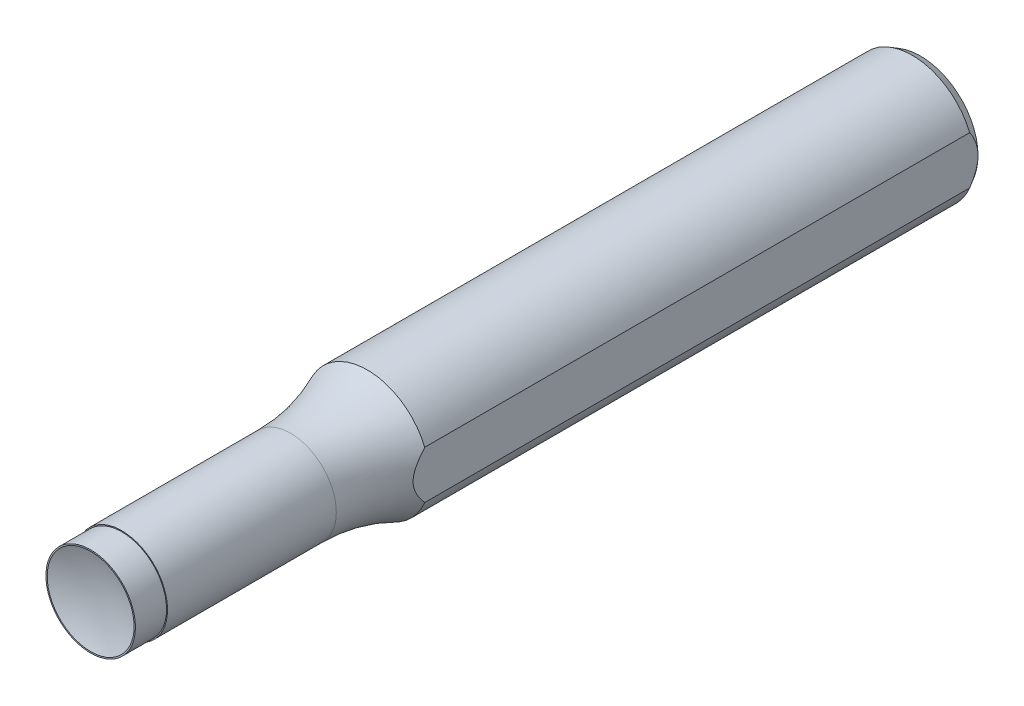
ISO-10303-21;
HEADER;
FILE_DESCRIPTION(('STEP AP214'),'2;1');
FILE_NAME('part.step','',(''),(''),'','','');
FILE_SCHEMA(('AUTOMOTIVE_DESIGN { 1 0 10303 214 1 1 1 1 }'));
ENDSEC;
DATA;
#1=APPLICATION_CONTEXT('core data for automotive mechanical design processes');
#2=APPLICATION_PROTOCOL_DEFINITION('international standard','automotive_design',2000,#1);
#3=PRODUCT_CONTEXT('',#1,'mechanical');
#4=PRODUCT('Part','Part','',(#3));
#5=PRODUCT_RELATED_PRODUCT_CATEGORY('part','',(#4));
#6=PRODUCT_DEFINITION_FORMATION('','',#4);
#7=PRODUCT_DEFINITION_CONTEXT('part definition',#1,'design');
#8=PRODUCT_DEFINITION('design','',#6,#7);
#9=PRODUCT_DEFINITION_SHAPE('','',#8);
#10=(LENGTH_UNIT() NAMED_UNIT(*) SI_UNIT(.MILLI.,.METRE.));
#11=(NAMED_UNIT(*) PLANE_ANGLE_UNIT() SI_UNIT($,.RADIAN.));
#12=(NAMED_UNIT(*) SI_UNIT($,.STERADIAN.) SOLID_ANGLE_UNIT());
#13=UNCERTAINTY_MEASURE_WITH_UNIT(LENGTH_MEASURE(1.E-05),#10,'distance_accuracy_value','');
#14=(GEOMETRIC_REPRESENTATION_CONTEXT(3) GLOBAL_UNCERTAINTY_ASSIGNED_CONTEXT((#13)) GLOBAL_UNIT_ASSIGNED_CONTEXT((#10,
#11,#12)) REPRESENTATION_CONTEXT('',''));
#15=CARTESIAN_POINT('',(0.,0.,0.));
#16=DIRECTION('',(0.,0.,1.));
#17=DIRECTION('',(1.,0.,0.));
#18=AXIS2_PLACEMENT_3D('',#15,#16,#17);
#19=CARTESIAN_POINT('',(0.,0.,-42.3333333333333));
#20=DIRECTION('',(0.,0.,1.));
#21=DIRECTION('',(1.,0.,0.));
#22=AXIS2_PLACEMENT_3D('',#19,#20,#21);
#23=CYLINDRICAL_SURFACE('',#22,7.);
#24=CARTESIAN_POINT('',(0.,0.,-30.5890528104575));
#25=DIRECTION('',(0.,0.,1.));
#26=DIRECTION('',(0.,-1.,0.));
#27=AXIS2_PLACEMENT_3D('',#24,#25,#26);
#28=CIRCLE('',#27,7.);
#29=CARTESIAN_POINT('',(0.,-7.,-30.5890528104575));
#30=VERTEX_POINT('',#29);
#31=EDGE_CURVE('E79',#30,#30,#28,.F.);
#32=ORIENTED_EDGE('',*,*,#31,.F.);
#33=EDGE_LOOP('',(#32));
#34=FACE_BOUND('',#33,.T.);
#35=CARTESIAN_POINT('',(0.,0.,-4.7625));
#36=DIRECTION('',(0.,0.,1.));
#37=DIRECTION('',(1.,0.,0.));
#38=AXIS2_PLACEMENT_3D('',#35,#36,#37);
#39=CIRCLE('',#38,7.);
#40=CARTESIAN_POINT('',(7.,0.,-4.7625));
#41=VERTEX_POINT('',#40);
#42=EDGE_CURVE('E90',#41,#41,#39,.F.);
#43=ORIENTED_EDGE('',*,*,#42,.T.);
#44=EDGE_LOOP('',(#43));
#45=FACE_BOUND('',#44,.T.);
#46=ADVANCED_FACE('F42',(#34,#45),#23,.T.);
#47=CARTESIAN_POINT('',(0.,0.,-4.7625));
#48=DIRECTION('',(0.,0.,1.));
#49=DIRECTION('',(1.,0.,0.));
#50=AXIS2_PLACEMENT_3D('',#47,#48,#49);
#51=PLANE('',#50);
#52=ORIENTED_EDGE('',*,*,#42,.F.);
#53=EDGE_LOOP('',(#52));
#54=FACE_BOUND('',#53,.T.);
#55=CARTESIAN_POINT('',(0.,0.,-4.7625));
#56=DIRECTION('',(0.,0.,1.));
#57=DIRECTION('',(1.,0.,0.));
#58=AXIS2_PLACEMENT_3D('',#55,#56,#57);
#59=CIRCLE('',#58,6.85);
#60=CARTESIAN_POINT('',(6.85,0.,-4.7625));
#61=VERTEX_POINT('',#60);
#62=EDGE_CURVE('E97',#61,#61,#59,.T.);
#63=ORIENTED_EDGE('',*,*,#62,.F.);
#64=EDGE_LOOP('',(#63));
#65=FACE_BOUND('',#64,.T.);
#66=ADVANCED_FACE('F108',(#54,#65),#51,.T.);
#67=CARTESIAN_POINT('',(0.,0.,-4.7625));
#68=DIRECTION('',(0.,0.,1.));
#69=DIRECTION('',(1.,0.,0.));
#70=AXIS2_PLACEMENT_3D('',#67,#68,#69);
#71=CYLINDRICAL_SURFACE('',#70,6.85);
#72=CARTESIAN_POINT('',(0.,0.,0.));
#73=DIRECTION('',(0.,0.,1.));
#74=DIRECTION('',(1.,0.,0.));
#75=AXIS2_PLACEMENT_3D('',#72,#73,#74);
#76=CIRCLE('',#75,6.85);
#77=CARTESIAN_POINT('',(6.85,0.,0.));
#78=VERTEX_POINT('',#77);
#79=EDGE_CURVE('E120',#78,#78,#76,.T.);
#80=CARTESIAN_POINT('',(6.85,0.,-4.7625));
#81=CARTESIAN_POINT('',(6.85,0.,-4.712890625));
#82=CARTESIAN_POINT('',(6.85,0.,-4.66328125));
#83=CARTESIAN_POINT('',(6.85,0.,-4.5640625));
#84=CARTESIAN_POINT('',(6.85,0.,-4.514453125));
#85=CARTESIAN_POINT('',(6.85,0.,-4.415234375));
#86=CARTESIAN_POINT('',(6.85,0.,-4.365625));
#87=CARTESIAN_POINT('',(6.85,0.,-4.26640625));
#88=CARTESIAN_POINT('',(6.85,0.,-4.216796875));
#89=CARTESIAN_POINT('',(6.85,0.,-4.117578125));
#90=CARTESIAN_POINT('',(6.85,0.,-4.06796875));
#91=CARTESIAN_POINT('',(6.85,0.,-3.96875));
#92=CARTESIAN_POINT('',(6.85,0.,-3.919140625));
#93=CARTESIAN_POINT('',(6.85,0.,-3.819921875));
#94=CARTESIAN_POINT('',(6.85,0.,-3.7703125));
#95=CARTESIAN_POINT('',(6.85,0.,-3.67109375));
#96=CARTESIAN_POINT('',(6.85,0.,-3.621484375));
#97=CARTESIAN_POINT('',(6.85,0.,-3.522265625));
#98=CARTESIAN_POINT('',(6.85,0.,-3.47265625));
#99=CARTESIAN_POINT('',(6.85,0.,-3.3734375));
#100=CARTESIAN_POINT('',(6.85,0.,-3.323828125));
#101=CARTESIAN_POINT('',(6.85,0.,-3.224609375));
#102=CARTESIAN_POINT('',(6.85,0.,-3.175));
#103=CARTESIAN_POINT('',(6.85,0.,-3.07578125));
#104=CARTESIAN_POINT('',(6.85,0.,-3.026171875));
#105=CARTESIAN_POINT('',(6.85,0.,-2.926953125));
#106=CARTESIAN_POINT('',(6.85,0.,-2.87734375));
#107=CARTESIAN_POINT('',(6.85,0.,-2.778125));
#108=CARTESIAN_POINT('',(6.85,0.,-2.728515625));
#109=CARTESIAN_POINT('',(6.85,0.,-2.629296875));
#110=CARTESIAN_POINT('',(6.85,0.,-2.5796875));
#111=CARTESIAN_POINT('',(6.85,0.,-2.48046875));
#112=CARTESIAN_POINT('',(6.85,0.,-2.430859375));
#113=CARTESIAN_POINT('',(6.85,0.,-2.331640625));
#114=CARTESIAN_POINT('',(6.85,0.,-2.28203125));
#115=CARTESIAN_POINT('',(6.85,0.,-2.1828125));
#116=CARTESIAN_POINT('',(6.85,0.,-2.133203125));
#117=CARTESIAN_POINT('',(6.85,0.,-2.033984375));
#118=CARTESIAN_POINT('',(6.85,0.,-1.984375));
#119=CARTESIAN_POINT('',(6.85,0.,-1.88515625));
#120=CARTESIAN_POINT('',(6.85,0.,-1.835546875));
#121=CARTESIAN_POINT('',(6.85,0.,-1.736328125));
#122=CARTESIAN_POINT('',(6.85,0.,-1.68671875));
#123=CARTESIAN_POINT('',(6.85,0.,-1.5875));
#124=CARTESIAN_POINT('',(6.85,0.,-1.537890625));
#125=CARTESIAN_POINT('',(6.85,0.,-1.438671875));
#126=CARTESIAN_POINT('',(6.85,0.,-1.3890625));
#127=CARTESIAN_POINT('',(6.85,0.,-1.28984375));
#128=CARTESIAN_POINT('',(6.85,0.,-1.240234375));
#129=CARTESIAN_POINT('',(6.85,0.,-1.141015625));
#130=CARTESIAN_POINT('',(6.85,0.,-1.09140625));
#131=CARTESIAN_POINT('',(6.85,0.,-0.9921875));
#132=CARTESIAN_POINT('',(6.85,0.,-0.942578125));
#133=CARTESIAN_POINT('',(6.85,0.,-0.843359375));
#134=CARTESIAN_POINT('',(6.85,0.,-0.79375));
#135=CARTESIAN_POINT('',(6.85,0.,-0.69453125));
#136=CARTESIAN_POINT('',(6.85,0.,-0.644921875));
#137=CARTESIAN_POINT('',(6.85,0.,-0.545703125));
#138=CARTESIAN_POINT('',(6.85,0.,-0.49609375));
#139=CARTESIAN_POINT('',(6.85,0.,-0.396875));
#140=CARTESIAN_POINT('',(6.85,0.,-0.347265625));
#141=CARTESIAN_POINT('',(6.85,0.,-0.248046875));
#142=CARTESIAN_POINT('',(6.85,0.,-0.1984375));
#143=CARTESIAN_POINT('',(6.85,0.,-0.09921875));
#144=CARTESIAN_POINT('',(6.85,0.,-0.049609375));
#145=CARTESIAN_POINT('',(6.85,0.,0.));
#146=B_SPLINE_CURVE_WITH_KNOTS('',3,(#80,#81,#82,#83,#84,#85,#86,#87,#88,#89,#90,#91,#92,#93,
#94,#95,#96,#97,#98,#99,#100,#101,#102,#103,#104,#105,#106,#107,#108,#109,#110,#111,#112,#113,
#114,#115,#116,#117,#118,#119,#120,#121,#122,#123,#124,#125,#126,#127,#128,#129,#130,#131,#132,
#133,#134,#135,#136,#137,#138,#139,#140,#141,#142,#143,#144,#145),.UNSPECIFIED.,.F.,.F.,(4,2,2,
2,2,2,2,2,2,2,2,2,2,2,2,2,2,2,2,2,2,2,2,2,2,2,2,2,2,2,2,2,4),(0.,0.148828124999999,
0.297656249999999,0.446484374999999,0.595312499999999,0.744140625,0.89296875,1.041796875,
1.190625,1.339453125,1.48828125,1.637109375,1.7859375,1.934765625,2.08359375,2.232421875,
2.38125,2.530078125,2.67890625,2.827734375,2.9765625,3.125390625,3.27421875,3.423046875,
3.571875,3.720703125,3.86953125,4.018359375,4.1671875,4.316015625,4.46484375,4.613671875,
4.7625),.UNSPECIFIED.);
#147=EDGE_CURVE('BSEAM114',#61,#78,#146,.T.);
#148=ORIENTED_EDGE('',*,*,#62,.T.);
#149=ORIENTED_EDGE('',*,*,#79,.F.);
#150=ORIENTED_EDGE('',*,*,#147,.T.);
#151=ORIENTED_EDGE('',*,*,#147,.F.);
#152=EDGE_LOOP('',(#148,#150,#149,#151));
#153=FACE_BOUND('',#152,.T.);
#154=ADVANCED_FACE('F114',(#153),#71,.T.);
#155=CARTESIAN_POINT('',(0.,0.,0.));
#156=DIRECTION('',(0.,0.,1.));
#157=DIRECTION('',(1.,0.,0.));
#158=AXIS2_PLACEMENT_3D('',#155,#156,#157);
#159=PLANE('',#158);
#160=CARTESIAN_POINT('',(0.,0.,0.));
#161=DIRECTION('',(0.,0.,1.));
#162=DIRECTION('',(0.,-1.,0.));
#163=AXIS2_PLACEMENT_3D('',#160,#161,#162);
#164=CIRCLE('',#163,6.65);
#165=CARTESIAN_POINT('',(0.,-6.65,0.));
#166=VERTEX_POINT('',#165);
#167=EDGE_CURVE('E125',#166,#166,#164,.T.);
#168=ORIENTED_EDGE('',*,*,#167,.F.);
#169=EDGE_LOOP('',(#168));
#170=FACE_BOUND('',#169,.T.);
#171=ORIENTED_EDGE('',*,*,#79,.T.);
#172=EDGE_LOOP('',(#171));
#173=FACE_BOUND('',#172,.T.);
#174=ADVANCED_FACE('F156',(#170,#173),#159,.T.);
#175=CARTESIAN_POINT('',(0.,0.,17.8516105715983));
#176=DIRECTION('',(0.,0.,1.));
#177=DIRECTION('',(0.,-1.,0.));
#178=AXIS2_PLACEMENT_3D('',#175,#176,#177);
#179=SPHERICAL_SURFACE('',#178,19.05);
#180=ORIENTED_EDGE('',*,*,#167,.T.);
#181=EDGE_LOOP('',(#180));
#182=FACE_BOUND('',#181,.T.);
#183=ADVANCED_FACE('F159',(#182),#179,.F.);
#184=CARTESIAN_POINT('',(0.,0.,-30.5890528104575));
#185=DIRECTION('',(0.,0.,-1.));
#186=DIRECTION('',(0.,1.,0.));
#187=AXIS2_PLACEMENT_3D('',#184,#185,#186);
#188=TOROIDAL_SURFACE('',#187,35.575,28.575);
#189=CARTESIAN_POINT('',(8.79176515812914,17.5087376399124,-54.2761391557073));
#190=CARTESIAN_POINT('',(8.79176515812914,17.0999941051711,-54.0296924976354));
#191=CARTESIAN_POINT('',(8.79176515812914,16.6959674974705,-53.7754833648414));
#192=CARTESIAN_POINT('',(8.79176515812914,15.8974976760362,-53.2525798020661));
#193=CARTESIAN_POINT('',(8.79176515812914,15.5030527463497,-52.9838879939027));
#194=CARTESIAN_POINT('',(8.79176515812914,14.7244521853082,-52.4334667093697));
#195=CARTESIAN_POINT('',(8.79176515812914,14.3402792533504,-52.151761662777));
#196=CARTESIAN_POINT('',(8.79176515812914,13.5813525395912,-51.5759212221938));
#197=CARTESIAN_POINT('',(8.79176515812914,13.2065991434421,-51.2817853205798));
#198=CARTESIAN_POINT('',(8.79176515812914,12.4766632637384,-50.6906788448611));
#199=CARTESIAN_POINT('',(8.79176515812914,12.1212268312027,-50.3940212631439));
#200=CARTESIAN_POINT('',(8.79176515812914,11.4185166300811,-49.7911866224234));
#201=CARTESIAN_POINT('',(8.79176515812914,11.0712431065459,-49.4850092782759));
#202=CARTESIAN_POINT('',(8.79176515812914,10.3840797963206,-48.8643268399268));
#203=CARTESIAN_POINT('',(8.79176515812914,10.044191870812,-48.5498196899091));
#204=CARTESIAN_POINT('',(8.79176515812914,9.37087770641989,-47.9139809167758));
#205=CARTESIAN_POINT('',(8.79176515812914,9.03745147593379,-47.5926492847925));
#206=CARTESIAN_POINT('',(8.79176515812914,8.42290396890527,-46.9911372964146));
#207=CARTESIAN_POINT('',(8.79176515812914,8.1411153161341,-46.7116361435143));
#208=CARTESIAN_POINT('',(8.79176515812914,7.57997806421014,-46.1501688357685));
#209=CARTESIAN_POINT('',(8.79176515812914,7.30062961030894,-45.8682025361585));
#210=CARTESIAN_POINT('',(8.79176515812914,6.73895187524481,-45.2996900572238));
#211=CARTESIAN_POINT('',(8.79176515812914,6.45663325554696,-45.0131334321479));
#212=CARTESIAN_POINT('',(8.79176515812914,5.89057752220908,-44.4417673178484));
#213=CARTESIAN_POINT('',(8.79176515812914,5.60684142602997,-44.1569568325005));
#214=CARTESIAN_POINT('',(8.79176515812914,5.1756209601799,-43.7318448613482));
#215=CARTESIAN_POINT('',(8.79176515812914,5.03003387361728,-43.5896255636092));
#216=CARTESIAN_POINT('',(8.79176515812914,4.73693142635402,-43.3071917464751));
#217=CARTESIAN_POINT('',(8.79176515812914,4.58941613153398,-43.1669771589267));
#218=CARTESIAN_POINT('',(8.79176515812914,4.29126843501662,-42.8889890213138));
#219=CARTESIAN_POINT('',(8.79176515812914,4.14062804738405,-42.7512240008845));
#220=CARTESIAN_POINT('',(8.79176515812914,3.83574022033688,-42.4797527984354));
#221=CARTESIAN_POINT('',(8.79176515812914,3.68149315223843,-42.3460462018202));
#222=CARTESIAN_POINT('',(8.79176515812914,3.37081251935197,-42.0864661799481));
#223=CARTESIAN_POINT('',(8.79176515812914,3.21445708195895,-41.9604998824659));
#224=CARTESIAN_POINT('',(8.79176515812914,2.89570532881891,-41.7161859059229));
#225=CARTESIAN_POINT('',(8.79176515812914,2.73330583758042,-41.5978423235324));
#226=CARTESIAN_POINT('',(8.79176515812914,2.40192137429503,-41.3726464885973));
#227=CARTESIAN_POINT('',(8.79176515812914,2.23297649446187,-41.2657358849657));
#228=CARTESIAN_POINT('',(8.79176515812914,1.88634676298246,-41.0673347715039));
#229=CARTESIAN_POINT('',(8.79176515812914,1.7086755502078,-40.9758211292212));
#230=CARTESIAN_POINT('',(8.79176515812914,1.42965244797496,-40.8524149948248));
#231=CARTESIAN_POINT('',(8.79176515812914,1.331741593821,-40.8127344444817));
#232=CARTESIAN_POINT('',(8.79176515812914,1.13325075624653,-40.7405202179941));
#233=CARTESIAN_POINT('',(8.79176515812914,1.0326699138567,-40.707988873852));
#234=CARTESIAN_POINT('',(8.79176515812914,0.829372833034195,-40.6512762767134));
#235=CARTESIAN_POINT('',(8.79176515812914,0.726661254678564,-40.6270784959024));
#236=CARTESIAN_POINT('',(8.79176515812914,0.519490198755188,-40.5879602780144));
#237=CARTESIAN_POINT('',(8.79176515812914,0.415031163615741,-40.5730375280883));
#238=CARTESIAN_POINT('',(8.79176515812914,0.204193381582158,-40.5530868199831));
#239=CARTESIAN_POINT('',(8.79176515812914,0.0978058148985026,-40.5481506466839));
#240=CARTESIAN_POINT('',(8.79176515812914,-0.114938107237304,-40.5487079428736));
#241=CARTESIAN_POINT('',(8.79176515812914,-0.221294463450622,-40.5542011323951));
#242=CARTESIAN_POINT('',(8.79176515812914,-0.433087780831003,-40.575339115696));
#243=CARTESIAN_POINT('',(8.79176515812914,-0.538523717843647,-40.5909940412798));
#244=CARTESIAN_POINT('',(8.79176515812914,-0.747574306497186,-40.631706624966));
#245=CARTESIAN_POINT('',(8.79176515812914,-0.851188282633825,-40.6567676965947));
#246=CARTESIAN_POINT('',(8.79176515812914,-1.08640136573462,-40.7239189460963));
#247=CARTESIAN_POINT('',(8.79176515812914,-1.21718553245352,-40.7688553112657));
#248=CARTESIAN_POINT('',(8.79176515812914,-1.47418586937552,-40.870254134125));
#249=CARTESIAN_POINT('',(8.79176515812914,-1.60039984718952,-40.9267220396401));
#250=CARTESIAN_POINT('',(8.79176515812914,-1.84877679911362,-41.0490737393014));
#251=CARTESIAN_POINT('',(8.79176515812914,-1.97092085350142,-41.1149955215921));
#252=CARTESIAN_POINT('',(8.79176515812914,-2.21091404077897,-41.2540802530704));
#253=CARTESIAN_POINT('',(8.79176515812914,-2.32876455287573,-41.3272408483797));
#254=CARTESIAN_POINT('',(8.79176515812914,-2.66136694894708,-41.5451480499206));
#255=CARTESIAN_POINT('',(8.79176515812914,-2.87148790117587,-41.6969361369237));
#256=CARTESIAN_POINT('',(8.79176515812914,-3.2821010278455,-42.0131102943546));
#257=CARTESIAN_POINT('',(8.79176515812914,-3.48258380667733,-42.1775082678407));
#258=CARTESIAN_POINT('',(8.79176515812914,-3.87711913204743,-42.5149394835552));
#259=CARTESIAN_POINT('',(8.79176515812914,-4.07115093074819,-42.6879968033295));
#260=CARTESIAN_POINT('',(8.79176515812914,-4.45423165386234,-43.0393517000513));
#261=CARTESIAN_POINT('',(8.79176515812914,-4.64328242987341,-43.2176472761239));
#262=CARTESIAN_POINT('',(8.79176515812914,-5.01976712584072,-43.5792035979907));
#263=CARTESIAN_POINT('',(8.79176515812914,-5.20717222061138,-43.7624942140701));
#264=CARTESIAN_POINT('',(8.79176515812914,-5.57995971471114,-44.1311405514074));
#265=CARTESIAN_POINT('',(8.79176515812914,-5.76534195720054,-44.3164964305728));
#266=CARTESIAN_POINT('',(8.79176515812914,-6.13476750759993,-44.6879415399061));
#267=CARTESIAN_POINT('',(8.79176515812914,-6.31881249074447,-44.8740291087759));
#268=CARTESIAN_POINT('',(8.79176515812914,-6.6866440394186,-45.2464614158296));
#269=CARTESIAN_POINT('',(8.79176515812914,-6.87043060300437,-45.4328061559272));
#270=CARTESIAN_POINT('',(8.79176515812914,-7.25383240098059,-45.8207876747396));
#271=CARTESIAN_POINT('',(8.79176515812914,-7.45347947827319,-46.0223931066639));
#272=CARTESIAN_POINT('',(8.79176515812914,-7.85382896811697,-46.4245526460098));
#273=CARTESIAN_POINT('',(8.79176515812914,-8.0545313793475,-46.6251067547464));
#274=CARTESIAN_POINT('',(8.79176515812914,-8.65900549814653,-47.2243833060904));
#275=CARTESIAN_POINT('',(8.79176515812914,-9.06515147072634,-47.6207275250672));
#276=CARTESIAN_POINT('',(8.79176515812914,-9.88670175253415,-48.4036355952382));
#277=CARTESIAN_POINT('',(8.79176515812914,-10.3021048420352,-48.7902007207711));
#278=CARTESIAN_POINT('',(8.79176515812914,-11.1441182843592,-49.5509151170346));
#279=CARTESIAN_POINT('',(8.79176515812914,-11.5707279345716,-49.9250651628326));
#280=CARTESIAN_POINT('',(8.79176515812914,-12.4353326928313,-50.6577550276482));
#281=CARTESIAN_POINT('',(8.79176515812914,-12.8732963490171,-51.016331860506));
#282=CARTESIAN_POINT('',(8.79176515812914,-13.7623200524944,-51.7168283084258));
#283=CARTESIAN_POINT('',(8.79176515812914,-14.2133790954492,-52.0587491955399));
#284=CARTESIAN_POINT('',(8.79176515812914,-15.130510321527,-52.7252370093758));
#285=CARTESIAN_POINT('',(8.79176515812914,-15.596628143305,-53.0497412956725));
#286=CARTESIAN_POINT('',(8.79176515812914,-16.5425030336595,-53.6785502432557));
#287=CARTESIAN_POINT('',(8.79176515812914,-17.0222645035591,-53.9828482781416));
#288=CARTESIAN_POINT('',(8.79176515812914,-17.5087376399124,-54.2761391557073));
#289=B_SPLINE_CURVE_WITH_KNOTS('',3,(#189,#190,#191,#192,#193,#194,#195,#196,#197,#198,#199,
#200,#201,#202,#203,#204,#205,#206,#207,#208,#209,#210,#211,#212,#213,#214,#215,#216,#217,#218,
#219,#220,#221,#222,#223,#224,#225,#226,#227,#228,#229,#230,#231,#232,#233,#234,#235,#236,#237,
#238,#239,#240,#241,#242,#243,#244,#245,#246,#247,#248,#249,#250,#251,#252,#253,#254,#255,#256,
#257,#258,#259,#260,#261,#262,#263,#264,#265,#266,#267,#268,#269,#270,#271,#272,#273,#274,#275,
#276,#277,#278,#279,#280,#281,#282,#283,#284,#285,#286,#287,#288),.UNSPECIFIED.,.F.,.F.,(4,2,2,
2,2,2,2,2,2,2,2,2,2,2,2,2,2,2,2,2,2,2,2,2,2,2,2,2,2,2,2,2,2,2,2,2,2,2,2,2,2,2,2,2,2,2,2,2,2,4),
(0.,1.43174280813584,2.86322729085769,4.29212575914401,5.72108263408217,7.10980579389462,
8.49857059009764,9.88768139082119,11.2767939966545,12.4674573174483,13.6581910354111,
14.864997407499,16.0710355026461,16.6815938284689,17.2921313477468,17.9044901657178,
18.5167862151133,19.1189746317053,19.7214840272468,20.3207546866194,20.9191168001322,
21.235830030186,21.5526464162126,21.8688307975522,22.1849363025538,22.5039341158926,
22.8229233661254,23.1422311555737,23.4616549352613,23.8758221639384,24.290185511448,
24.7062631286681,25.1222058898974,25.8989934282,26.6765234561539,27.4563506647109,
28.2358837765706,29.0222699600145,29.8087166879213,30.5938971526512,31.3790834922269,
32.2302759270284,33.0814672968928,34.7838183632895,36.4859464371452,38.1879680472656,
39.8856941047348,41.5832902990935,43.2866310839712,44.9905277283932),.UNSPECIFIED.);
#290=CARTESIAN_POINT('',(8.79176515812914,3.66476334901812,-42.3333333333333));
#291=VERTEX_POINT('',#290);
#292=CARTESIAN_POINT('',(8.79176515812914,-3.66476334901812,-42.3333333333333));
#293=VERTEX_POINT('',#292);
#294=EDGE_CURVE('E58',#291,#293,#289,.T.);
#295=ORIENTED_EDGE('',*,*,#294,.F.);
#296=CARTESIAN_POINT('',(0.,0.,-42.3333333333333));
#297=DIRECTION('',(0.,0.,-1.));
#298=DIRECTION('',(0.,1.,0.));
#299=AXIS2_PLACEMENT_3D('',#296,#297,#298);
#300=CIRCLE('',#299,9.525);
#301=EDGE_CURVE('E130',#293,#291,#300,.T.);
#302=ORIENTED_EDGE('',*,*,#301,.F.);
#303=EDGE_LOOP('',(#295,#302));
#304=FACE_BOUND('',#303,.T.);
#305=ORIENTED_EDGE('',*,*,#31,.T.);
#306=EDGE_LOOP('',(#305));
#307=FACE_BOUND('',#306,.T.);
#308=ADVANCED_FACE('F104',(#304,#307),#188,.F.);
#309=CARTESIAN_POINT('',(0.,0.,-127.));
#310=DIRECTION('',(0.,0.,1.));
#311=DIRECTION('',(1.,0.,0.));
#312=AXIS2_PLACEMENT_3D('',#309,#310,#311);
#313=PLANE('',#312);
#314=CARTESIAN_POINT('',(0.,0.,-127.));
#315=DIRECTION('',(0.,0.,1.));
#316=DIRECTION('',(1.,0.,0.));
#317=AXIS2_PLACEMENT_3D('',#314,#315,#316);
#318=CIRCLE('',#317,8.79176515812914);
#319=CARTESIAN_POINT('',(8.79176515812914,0.,-127.));
#320=VERTEX_POINT('',#319);
#321=EDGE_CURVE('E85',#320,#320,#318,.F.);
#322=ORIENTED_EDGE('',*,*,#321,.T.);
#323=EDGE_LOOP('',(#322));
#324=FACE_BOUND('',#323,.T.);
#325=ADVANCED_FACE('F154',(#324),#313,.F.);
#326=CARTESIAN_POINT('',(0.,0.,-125.73));
#327=DIRECTION('',(0.,0.,1.));
#328=DIRECTION('',(1.,0.,0.));
#329=AXIS2_PLACEMENT_3D('',#326,#327,#328);
#330=CONICAL_SURFACE('',#329,9.525,0.523598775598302);
#331=CARTESIAN_POINT('',(8.79176515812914,-10.6627291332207,-118.291059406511));
#332=CARTESIAN_POINT('',(8.79176515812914,-10.4736349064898,-118.543726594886));
#333=CARTESIAN_POINT('',(8.79176515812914,-10.2832608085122,-118.795444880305));
#334=CARTESIAN_POINT('',(8.79176515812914,-9.89950978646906,-119.296621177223));
#335=CARTESIAN_POINT('',(8.79176515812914,-9.70613255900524,-119.546078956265));
#336=CARTESIAN_POINT('',(8.79176515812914,-9.31543210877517,-120.043004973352));
#337=CARTESIAN_POINT('',(8.79176515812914,-9.11809946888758,-120.290465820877));
#338=CARTESIAN_POINT('',(8.79176515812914,-8.71947539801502,-120.782169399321));
#339=CARTESIAN_POINT('',(8.79176515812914,-8.51818410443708,-121.02641224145));
#340=CARTESIAN_POINT('',(8.79176515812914,-8.10883988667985,-121.513581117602));
#341=CARTESIAN_POINT('',(8.79176515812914,-7.90073806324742,-121.75646615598));
#342=CARTESIAN_POINT('',(8.79176515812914,-7.47900201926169,-122.237381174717));
#343=CARTESIAN_POINT('',(8.79176515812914,-7.26536803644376,-122.475411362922));
#344=CARTESIAN_POINT('',(8.79176515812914,-6.83176075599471,-122.945188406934));
#345=CARTESIAN_POINT('',(8.79176515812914,-6.61179425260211,-123.176941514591));
#346=CARTESIAN_POINT('',(8.79176515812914,-6.16407664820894,-123.632773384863));
#347=CARTESIAN_POINT('',(8.79176515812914,-5.93632693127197,-123.8568534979));
#348=CARTESIAN_POINT('',(8.79176515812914,-5.54045643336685,-124.230031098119));
#349=CARTESIAN_POINT('',(8.79176515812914,-5.37470587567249,-124.381639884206));
#350=CARTESIAN_POINT('',(8.79176515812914,-5.03789628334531,-124.678893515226));
#351=CARTESIAN_POINT('',(8.79176515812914,-4.86683687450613,-124.82453793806));
#352=CARTESIAN_POINT('',(8.79176515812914,-4.51838676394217,-125.108734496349));
#353=CARTESIAN_POINT('',(8.79176515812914,-4.34098532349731,-125.247273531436));
#354=CARTESIAN_POINT('',(8.79176515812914,-3.97934788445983,-125.515187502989));
#355=CARTESIAN_POINT('',(8.79176515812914,-3.7951118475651,-125.644562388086));
#356=CARTESIAN_POINT('',(8.79176515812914,-3.4160021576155,-125.8938050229));
#357=CARTESIAN_POINT('',(8.79176515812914,-3.22100525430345,-126.013486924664));
#358=CARTESIAN_POINT('',(8.79176515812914,-2.82243264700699,-126.23787253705));
#359=CARTESIAN_POINT('',(8.79176515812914,-2.61885540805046,-126.34257355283));
#360=CARTESIAN_POINT('',(8.79176515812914,-2.20394674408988,-126.532622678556));
#361=CARTESIAN_POINT('',(8.79176515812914,-1.99265771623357,-126.618062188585));
#362=CARTESIAN_POINT('',(8.79176515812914,-1.56214573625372,-126.765790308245));
#363=CARTESIAN_POINT('',(8.79176515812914,-1.34292980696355,-126.828098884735));
#364=CARTESIAN_POINT('',(8.79176515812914,-0.975279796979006,-126.908636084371));
#365=CARTESIAN_POINT('',(8.79176515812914,-0.828532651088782,-126.9346562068));
#366=CARTESIAN_POINT('',(8.79176515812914,-0.533370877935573,-126.974128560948));
#367=CARTESIAN_POINT('',(8.79176515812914,-0.384956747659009,-126.987584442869));
#368=CARTESIAN_POINT('',(8.79176515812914,-0.0875373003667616,-127.001421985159));
#369=CARTESIAN_POINT('',(8.79176515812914,0.0614679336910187,-127.00180541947));
#370=CARTESIAN_POINT('',(8.79176515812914,0.358938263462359,-126.989490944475));
#371=CARTESIAN_POINT('',(8.79176515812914,0.507403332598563,-126.976792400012));
#372=CARTESIAN_POINT('',(8.79176515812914,0.802087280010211,-126.938868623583));
#373=CARTESIAN_POINT('',(8.79176515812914,0.948312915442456,-126.913695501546));
#374=CARTESIAN_POINT('',(8.79176515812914,1.23830007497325,-126.851720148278));
#375=CARTESIAN_POINT('',(8.79176515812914,1.38206055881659,-126.814913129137));
#376=CARTESIAN_POINT('',(8.79176515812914,1.80870609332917,-126.688658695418));
#377=CARTESIAN_POINT('',(8.79176515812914,2.08697532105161,-126.583375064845));
#378=CARTESIAN_POINT('',(8.79176515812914,2.60337361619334,-126.351752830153));
#379=CARTESIAN_POINT('',(8.79176515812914,2.84283329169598,-126.228267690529));
#380=CARTESIAN_POINT('',(8.79176515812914,3.31023059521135,-125.960874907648));
#381=CARTESIAN_POINT('',(8.79176515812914,3.53815770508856,-125.816949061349));
#382=CARTESIAN_POINT('',(8.79176515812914,3.98547376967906,-125.512244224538));
#383=CARTESIAN_POINT('',(8.79176515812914,4.20476189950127,-125.351319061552));
#384=CARTESIAN_POINT('',(8.79176515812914,4.63383214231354,-125.017538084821));
#385=CARTESIAN_POINT('',(8.79176515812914,4.84361821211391,-124.844687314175));
#386=CARTESIAN_POINT('',(8.79176515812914,5.32521022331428,-124.429271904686));
#387=CARTESIAN_POINT('',(8.79176515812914,5.59381264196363,-124.183009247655));
#388=CARTESIAN_POINT('',(8.79176515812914,6.11939033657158,-123.678310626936));
#389=CARTESIAN_POINT('',(8.79176515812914,6.37636135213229,-123.419870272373));
#390=CARTESIAN_POINT('',(8.79176515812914,6.88131611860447,-122.893337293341));
#391=CARTESIAN_POINT('',(8.79176515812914,7.12927952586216,-122.625225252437));
#392=CARTESIAN_POINT('',(8.79176515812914,7.61732781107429,-122.082023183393));
#393=CARTESIAN_POINT('',(8.79176515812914,7.85741379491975,-121.806934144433));
#394=CARTESIAN_POINT('',(8.79176515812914,8.31828668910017,-121.266255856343));
#395=CARTESIAN_POINT('',(8.79176515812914,8.53941529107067,-121.000956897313));
#396=CARTESIAN_POINT('',(8.79176515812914,8.97677143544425,-120.466333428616));
#397=CARTESIAN_POINT('',(8.79176515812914,9.192998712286,-120.197008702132));
#398=CARTESIAN_POINT('',(8.79176515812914,9.62018291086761,-119.656440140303));
#399=CARTESIAN_POINT('',(8.79176515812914,9.83116104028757,-119.385213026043));
#400=CARTESIAN_POINT('',(8.79176515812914,10.2495056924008,-118.840049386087));
#401=CARTESIAN_POINT('',(8.79176515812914,10.4568727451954,-118.566113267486));
#402=CARTESIAN_POINT('',(8.79176515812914,10.6627291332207,-118.291059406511));
#403=B_SPLINE_CURVE_WITH_KNOTS('',3,(#331,#332,#333,#334,#335,#336,#337,#338,#339,#340,#341,
#342,#343,#344,#345,#346,#347,#348,#349,#350,#351,#352,#353,#354,#355,#356,#357,#358,#359,#360,
#361,#362,#363,#364,#365,#366,#367,#368,#369,#370,#371,#372,#373,#374,#375,#376,#377,#378,#379,
#380,#381,#382,#383,#384,#385,#386,#387,#388,#389,#390,#391,#392,#393,#394,#395,#396,#397,#398,
#399,#400,#401,#402),.UNSPECIFIED.,.F.,.F.,(4,2,2,2,2,2,2,2,2,2,2,2,2,2,2,2,2,2,2,2,2,2,2,2,2,2,
2,2,2,2,2,2,2,2,2,4),(0.,0.946777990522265,1.89365226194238,2.84313965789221,3.79259415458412,
4.75205342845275,5.71147153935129,6.66989605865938,7.6281510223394,8.30192536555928,
8.97574730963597,9.65076995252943,10.325796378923,11.0116535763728,11.697633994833,
12.3802873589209,13.0623500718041,13.508978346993,13.9554768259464,14.4019147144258,
14.8483742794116,15.2929843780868,15.7377776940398,16.6273040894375,17.4344385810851,
18.2422964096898,19.0577749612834,19.8729107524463,20.9655865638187,22.0586594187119,
23.1540643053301,24.2493147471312,25.2853610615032,26.3214633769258,27.3522974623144,
28.3829789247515),.UNSPECIFIED.);
#404=CARTESIAN_POINT('',(8.79176515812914,-3.66476334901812,-125.73));
#405=VERTEX_POINT('',#404);
#406=EDGE_CURVE('E73',#405,#320,#403,.T.);
#407=ORIENTED_EDGE('',*,*,#406,.F.);
#408=CARTESIAN_POINT('',(0.,0.,-125.73));
#409=DIRECTION('',(0.,0.,1.));
#410=DIRECTION('',(1.,0.,0.));
#411=AXIS2_PLACEMENT_3D('',#408,#409,#410);
#412=CIRCLE('',#411,9.525);
#413=CARTESIAN_POINT('',(8.79176515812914,3.66476334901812,-125.73));
#414=VERTEX_POINT('',#413);
#415=EDGE_CURVE('E83',#414,#405,#412,.T.);
#416=ORIENTED_EDGE('',*,*,#415,.F.);
#417=EDGE_CURVE('E64',#320,#414,#403,.T.);
#418=ORIENTED_EDGE('',*,*,#417,.F.);
#419=ORIENTED_EDGE('',*,*,#321,.F.);
#420=EDGE_LOOP('',(#407,#416,#418,#419));
#421=FACE_BOUND('',#420,.T.);
#422=ADVANCED_FACE('F44',(#421),#330,.T.);
#423=CARTESIAN_POINT('',(0.,0.,-127.));
#424=DIRECTION('',(0.,0.,1.));
#425=DIRECTION('',(1.,0.,0.));
#426=AXIS2_PLACEMENT_3D('',#423,#424,#425);
#427=CYLINDRICAL_SURFACE('',#426,9.525);
#428=DIRECTION('',(0.,0.,1.));
#429=VECTOR('',#428,1.);
#430=CARTESIAN_POINT('',(8.79176515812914,3.66476334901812,-127.));
#431=LINE('',#430,#429);
#432=EDGE_CURVE('E13',#414,#291,#431,.T.);
#433=ORIENTED_EDGE('',*,*,#432,.F.);
#434=ORIENTED_EDGE('',*,*,#415,.T.);
#435=DIRECTION('',(0.,0.,1.));
#436=VECTOR('',#435,1.);
#437=CARTESIAN_POINT('',(8.79176515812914,-3.66476334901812,-127.));
#438=LINE('',#437,#436);
#439=EDGE_CURVE('E52',#293,#405,#438,.F.);
#440=ORIENTED_EDGE('',*,*,#439,.F.);
#441=ORIENTED_EDGE('',*,*,#301,.T.);
#442=EDGE_LOOP('',(#433,#434,#440,#441));
#443=FACE_BOUND('',#442,.T.);
#444=ADVANCED_FACE('F88',(#443),#427,.T.);
#445=CARTESIAN_POINT('',(8.79176515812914,3.66476334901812,0.));
#446=DIRECTION('',(-1.,0.,0.));
#447=DIRECTION('',(0.,0.,1.));
#448=AXIS2_PLACEMENT_3D('',#445,#446,#447);
#449=PLANE('',#448);
#450=ORIENTED_EDGE('',*,*,#294,.T.);
#451=ORIENTED_EDGE('',*,*,#439,.T.);
#452=ORIENTED_EDGE('',*,*,#406,.T.);
#453=ORIENTED_EDGE('',*,*,#417,.T.);
#454=ORIENTED_EDGE('',*,*,#432,.T.);
#455=EDGE_LOOP('',(#450,#451,#452,#453,#454));
#456=FACE_BOUND('',#455,.T.);
#457=ADVANCED_FACE('F72',(#456),#449,.F.);
#458=CLOSED_SHELL('',(#46,#66,#154,#174,#183,#308,#325,#422,#444,#457));
#459=MANIFOLD_SOLID_BREP('B2',#458);
#460=ADVANCED_BREP_SHAPE_REPRESENTATION('',(#18,#459),#14);
#461=SHAPE_DEFINITION_REPRESENTATION(#9,#460);
ENDSEC;
END-ISO-10303-21;
